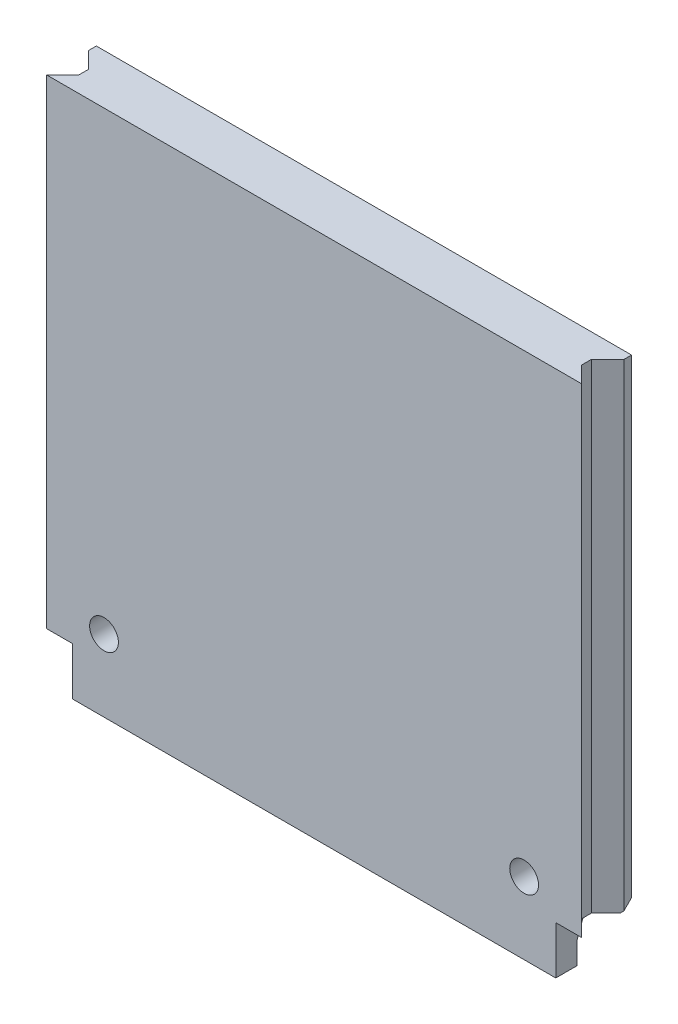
ISO-10303-21;
HEADER;
FILE_DESCRIPTION(('STEP AP214'),'2;1');
FILE_NAME('part.step','',(''),(''),'','','');
FILE_SCHEMA(('AUTOMOTIVE_DESIGN { 1 0 10303 214 1 1 1 1 }'));
ENDSEC;
DATA;
#1=APPLICATION_CONTEXT('core data for automotive mechanical design processes');
#2=APPLICATION_PROTOCOL_DEFINITION('international standard','automotive_design',2000,#1);
#3=PRODUCT_CONTEXT('',#1,'mechanical');
#4=PRODUCT('Part','Part','',(#3));
#5=PRODUCT_RELATED_PRODUCT_CATEGORY('part','',(#4));
#6=PRODUCT_DEFINITION_FORMATION('','',#4);
#7=PRODUCT_DEFINITION_CONTEXT('part definition',#1,'design');
#8=PRODUCT_DEFINITION('design','',#6,#7);
#9=PRODUCT_DEFINITION_SHAPE('','',#8);
#10=(LENGTH_UNIT() NAMED_UNIT(*) SI_UNIT(.MILLI.,.METRE.));
#11=(NAMED_UNIT(*) PLANE_ANGLE_UNIT() SI_UNIT($,.RADIAN.));
#12=(NAMED_UNIT(*) SI_UNIT($,.STERADIAN.) SOLID_ANGLE_UNIT());
#13=UNCERTAINTY_MEASURE_WITH_UNIT(LENGTH_MEASURE(1.E-05),#10,'distance_accuracy_value','');
#14=(GEOMETRIC_REPRESENTATION_CONTEXT(3) GLOBAL_UNCERTAINTY_ASSIGNED_CONTEXT((#13)) GLOBAL_UNIT_ASSIGNED_CONTEXT((#10,
#11,#12)) REPRESENTATION_CONTEXT('',''));
#15=CARTESIAN_POINT('',(0.,0.,0.));
#16=DIRECTION('',(0.,0.,1.));
#17=DIRECTION('',(1.,0.,0.));
#18=AXIS2_PLACEMENT_3D('',#15,#16,#17);
#19=CARTESIAN_POINT('',(-25.2022700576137,-5.,-1.));
#20=DIRECTION('',(1.,0.,0.));
#21=DIRECTION('',(0.,0.,-1.));
#22=AXIS2_PLACEMENT_3D('',#19,#20,#21);
#23=PLANE('',#22);
#24=DIRECTION('',(0.,1.,0.));
#25=VECTOR('',#24,1.);
#26=CARTESIAN_POINT('',(-25.2022700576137,-2.74747741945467,0.));
#27=LINE('',#26,#25);
#28=CARTESIAN_POINT('',(-25.2022700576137,-5.,0.));
#29=VERTEX_POINT('',#28);
#30=CARTESIAN_POINT('',(-25.2022700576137,-2.74747741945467,0.));
#31=VERTEX_POINT('',#30);
#32=EDGE_CURVE('E169',#29,#31,#27,.T.);
#33=ORIENTED_EDGE('',*,*,#32,.F.);
#34=DIRECTION('',(0.,0.,-1.));
#35=VECTOR('',#34,1.);
#36=CARTESIAN_POINT('',(-25.2022700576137,-5.,-1.));
#37=LINE('',#36,#35);
#38=CARTESIAN_POINT('',(-25.2022700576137,-5.,2.2));
#39=VERTEX_POINT('',#38);
#40=EDGE_CURVE('E185',#39,#29,#37,.T.);
#41=ORIENTED_EDGE('',*,*,#40,.F.);
#42=DIRECTION('',(0.,1.,0.));
#43=VECTOR('',#42,1.);
#44=CARTESIAN_POINT('',(-25.2022700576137,-5.,2.2));
#45=LINE('',#44,#43);
#46=CARTESIAN_POINT('',(-25.2022700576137,0.,2.2));
#47=VERTEX_POINT('',#46);
#48=EDGE_CURVE('E201',#39,#47,#45,.T.);
#49=ORIENTED_EDGE('',*,*,#48,.T.);
#50=DIRECTION('',(0.,0.,-1.));
#51=VECTOR('',#50,1.);
#52=CARTESIAN_POINT('',(-25.2022700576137,0.,-1.));
#53=LINE('',#52,#51);
#54=CARTESIAN_POINT('',(-25.2022700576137,0.,-1.));
#55=VERTEX_POINT('',#54);
#56=EDGE_CURVE('E207',#47,#55,#53,.T.);
#57=ORIENTED_EDGE('',*,*,#56,.T.);
#58=DIRECTION('',(0.,0.93969262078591,-0.342020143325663));
#59=VECTOR('',#58,1.);
#60=CARTESIAN_POINT('',(-25.2022700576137,0.,-1.));
#61=LINE('',#60,#59);
#62=EDGE_CURVE('E180',#31,#55,#61,.T.);
#63=ORIENTED_EDGE('',*,*,#62,.F.);
#64=EDGE_LOOP('',(#33,#41,#49,#57,#63));
#65=FACE_BOUND('',#64,.T.);
#66=ADVANCED_FACE('F50',(#65),#23,.F.);
#67=CARTESIAN_POINT('',(0.,-5.,0.));
#68=DIRECTION('',(0.,1.,0.));
#69=DIRECTION('',(0.,0.,1.));
#70=AXIS2_PLACEMENT_3D('',#67,#68,#69);
#71=PLANE('',#70);
#72=DIRECTION('',(-1.,0.,0.));
#73=VECTOR('',#72,1.);
#74=CARTESIAN_POINT('',(27.9,-5.,0.));
#75=LINE('',#74,#73);
#76=CARTESIAN_POINT('',(25.2,-5.,0.));
#77=VERTEX_POINT('',#76);
#78=EDGE_CURVE('E168',#77,#29,#75,.T.);
#79=ORIENTED_EDGE('',*,*,#78,.F.);
#80=DIRECTION('',(0.,0.,1.));
#81=VECTOR('',#80,1.);
#82=CARTESIAN_POINT('',(25.2,-5.,2.20000000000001));
#83=LINE('',#82,#81);
#84=CARTESIAN_POINT('',(25.2,-5.,2.20000000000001));
#85=VERTEX_POINT('',#84);
#86=EDGE_CURVE('E195',#77,#85,#83,.T.);
#87=ORIENTED_EDGE('',*,*,#86,.T.);
#88=DIRECTION('',(-1.,0.,0.));
#89=VECTOR('',#88,1.);
#90=CARTESIAN_POINT('',(-25.2022700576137,-5.,2.2));
#91=LINE('',#90,#89);
#92=EDGE_CURVE('E186',#85,#39,#91,.T.);
#93=ORIENTED_EDGE('',*,*,#92,.T.);
#94=ORIENTED_EDGE('',*,*,#40,.T.);
#95=EDGE_LOOP('',(#79,#87,#93,#94));
#96=FACE_BOUND('',#95,.T.);
#97=ADVANCED_FACE('F190',(#96),#71,.F.);
#98=CARTESIAN_POINT('',(0.,0.,0.));
#99=DIRECTION('',(0.,1.,0.));
#100=DIRECTION('',(0.,0.,1.));
#101=AXIS2_PLACEMENT_3D('',#98,#99,#100);
#102=PLANE('',#101);
#103=DIRECTION('',(0.,0.,1.));
#104=VECTOR('',#103,1.);
#105=CARTESIAN_POINT('',(25.2,0.,2.20000000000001));
#106=LINE('',#105,#104);
#107=CARTESIAN_POINT('',(25.2,0.,-1.));
#108=VERTEX_POINT('',#107);
#109=CARTESIAN_POINT('',(25.2,0.,2.2));
#110=VERTEX_POINT('',#109);
#111=EDGE_CURVE('E194',#108,#110,#106,.T.);
#112=ORIENTED_EDGE('',*,*,#111,.F.);
#113=DIRECTION('',(1.,0.,0.));
#114=VECTOR('',#113,1.);
#115=CARTESIAN_POINT('',(25.2,0.,-0.999999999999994));
#116=LINE('',#115,#114);
#117=EDGE_CURVE('E199',#55,#108,#116,.T.);
#118=ORIENTED_EDGE('',*,*,#117,.F.);
#119=ORIENTED_EDGE('',*,*,#56,.F.);
#120=DIRECTION('',(1.,0.,0.));
#121=VECTOR('',#120,1.);
#122=CARTESIAN_POINT('',(-27.9,0.,2.2));
#123=LINE('',#122,#121);
#124=CARTESIAN_POINT('',(-27.9,0.,2.2));
#125=VERTEX_POINT('',#124);
#126=EDGE_CURVE('E253',#125,#47,#123,.T.);
#127=ORIENTED_EDGE('',*,*,#126,.F.);
#128=DIRECTION('',(-0.707106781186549,0.,0.707106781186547));
#129=VECTOR('',#128,1.);
#130=CARTESIAN_POINT('',(-27.9,0.,2.2));
#131=LINE('',#130,#129);
#132=CARTESIAN_POINT('',(-26.2,0.,0.5));
#133=VERTEX_POINT('',#132);
#134=EDGE_CURVE('E220',#133,#125,#131,.T.);
#135=ORIENTED_EDGE('',*,*,#134,.F.);
#136=DIRECTION('',(0.,0.,1.));
#137=VECTOR('',#136,1.);
#138=CARTESIAN_POINT('',(-26.2,0.,0.5));
#139=LINE('',#138,#137);
#140=CARTESIAN_POINT('',(-26.2,0.,-0.5));
#141=VERTEX_POINT('',#140);
#142=EDGE_CURVE('E222',#141,#133,#139,.T.);
#143=ORIENTED_EDGE('',*,*,#142,.F.);
#144=DIRECTION('',(0.70710678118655,0.,0.707106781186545));
#145=VECTOR('',#144,1.);
#146=CARTESIAN_POINT('',(-26.2,0.,-0.5));
#147=LINE('',#146,#145);
#148=CARTESIAN_POINT('',(-27.7,0.,-2.));
#149=VERTEX_POINT('',#148);
#150=EDGE_CURVE('E267',#149,#141,#147,.T.);
#151=ORIENTED_EDGE('',*,*,#150,.F.);
#152=DIRECTION('',(1.,0.,0.));
#153=VECTOR('',#152,1.);
#154=CARTESIAN_POINT('',(0.,0.,-2.));
#155=LINE('',#154,#153);
#156=CARTESIAN_POINT('',(27.7,0.,-2.));
#157=VERTEX_POINT('',#156);
#158=EDGE_CURVE('E321',#149,#157,#155,.T.);
#159=ORIENTED_EDGE('',*,*,#158,.T.);
#160=DIRECTION('',(0.70710678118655,0.,-0.707106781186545));
#161=VECTOR('',#160,1.);
#162=CARTESIAN_POINT('',(26.2,0.,-0.5));
#163=LINE('',#162,#161);
#164=CARTESIAN_POINT('',(26.2,0.,-0.5));
#165=VERTEX_POINT('',#164);
#166=EDGE_CURVE('E261',#165,#157,#163,.T.);
#167=ORIENTED_EDGE('',*,*,#166,.F.);
#168=DIRECTION('',(0.,0.,-1.));
#169=VECTOR('',#168,1.);
#170=CARTESIAN_POINT('',(26.2,0.,0.5));
#171=LINE('',#170,#169);
#172=CARTESIAN_POINT('',(26.2,0.,0.5));
#173=VERTEX_POINT('',#172);
#174=EDGE_CURVE('E265',#173,#165,#171,.T.);
#175=ORIENTED_EDGE('',*,*,#174,.F.);
#176=DIRECTION('',(-0.707106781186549,0.,-0.707106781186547));
#177=VECTOR('',#176,1.);
#178=CARTESIAN_POINT('',(27.9,0.,2.2));
#179=LINE('',#178,#177);
#180=CARTESIAN_POINT('',(27.9,0.,2.2));
#181=VERTEX_POINT('',#180);
#182=EDGE_CURVE('E256',#181,#173,#179,.T.);
#183=ORIENTED_EDGE('',*,*,#182,.F.);
#184=EDGE_CURVE('E251',#110,#181,#123,.T.);
#185=ORIENTED_EDGE('',*,*,#184,.F.);
#186=EDGE_LOOP('',(#112,#118,#119,#127,#135,#143,#151,#159,#167,#175,#183,#185));
#187=FACE_BOUND('',#186,.T.);
#188=ADVANCED_FACE('F344',(#187),#102,.F.);
#189=CARTESIAN_POINT('',(-27.9,50.,2.2));
#190=DIRECTION('',(0.707106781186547,0.,0.707106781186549));
#191=DIRECTION('',(0.707106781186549,0.,-0.707106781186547));
#192=AXIS2_PLACEMENT_3D('',#189,#190,#191);
#193=PLANE('',#192);
#194=ORIENTED_EDGE('',*,*,#134,.T.);
#195=DIRECTION('',(0.,-1.,0.));
#196=VECTOR('',#195,1.);
#197=CARTESIAN_POINT('',(-27.9,50.,2.2));
#198=LINE('',#197,#196);
#199=CARTESIAN_POINT('',(-27.9,50.,2.2));
#200=VERTEX_POINT('',#199);
#201=EDGE_CURVE('E308',#200,#125,#198,.T.);
#202=ORIENTED_EDGE('',*,*,#201,.F.);
#203=DIRECTION('',(-0.707106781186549,0.,0.707106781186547));
#204=VECTOR('',#203,1.);
#205=CARTESIAN_POINT('',(-27.9,50.,2.2));
#206=LINE('',#205,#204);
#207=CARTESIAN_POINT('',(-26.2,50.,0.5));
#208=VERTEX_POINT('',#207);
#209=EDGE_CURVE('E218',#208,#200,#206,.T.);
#210=ORIENTED_EDGE('',*,*,#209,.F.);
#211=DIRECTION('',(0.,-1.,0.));
#212=VECTOR('',#211,1.);
#213=CARTESIAN_POINT('',(-26.2,50.,0.5));
#214=LINE('',#213,#212);
#215=EDGE_CURVE('E249',#208,#133,#214,.T.);
#216=ORIENTED_EDGE('',*,*,#215,.T.);
#217=EDGE_LOOP('',(#194,#202,#210,#216));
#218=FACE_BOUND('',#217,.T.);
#219=ADVANCED_FACE('F388',(#218),#193,.F.);
#220=CARTESIAN_POINT('',(-27.9,50.,2.2));
#221=DIRECTION('',(0.,0.,-1.));
#222=DIRECTION('',(-1.,0.,0.));
#223=AXIS2_PLACEMENT_3D('',#220,#221,#222);
#224=PLANE('',#223);
#225=CARTESIAN_POINT('',(21.9,2.49999999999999,2.20000000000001));
#226=DIRECTION('',(0.,0.,-1.));
#227=DIRECTION('',(-1.,0.,0.));
#228=AXIS2_PLACEMENT_3D('',#225,#226,#227);
#229=CIRCLE('',#228,1.5);
#230=CARTESIAN_POINT('',(20.4,2.49999999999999,2.20000000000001));
#231=VERTEX_POINT('',#230);
#232=EDGE_CURVE('E184',#231,#231,#229,.T.);
#233=ORIENTED_EDGE('',*,*,#232,.T.);
#234=EDGE_LOOP('',(#233));
#235=FACE_BOUND('',#234,.T.);
#236=CARTESIAN_POINT('',(-21.9,2.49999999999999,2.20000000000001));
#237=DIRECTION('',(0.,0.,-1.));
#238=DIRECTION('',(1.,0.,0.));
#239=AXIS2_PLACEMENT_3D('',#236,#237,#238);
#240=CIRCLE('',#239,1.5);
#241=CARTESIAN_POINT('',(-20.4,2.49999999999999,2.20000000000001));
#242=VERTEX_POINT('',#241);
#243=EDGE_CURVE('E353',#242,#242,#240,.T.);
#244=ORIENTED_EDGE('',*,*,#243,.T.);
#245=EDGE_LOOP('',(#244));
#246=FACE_BOUND('',#245,.T.);
#247=ORIENTED_EDGE('',*,*,#126,.T.);
#248=ORIENTED_EDGE('',*,*,#48,.F.);
#249=ORIENTED_EDGE('',*,*,#92,.F.);
#250=DIRECTION('',(0.,1.,0.));
#251=VECTOR('',#250,1.);
#252=CARTESIAN_POINT('',(25.2,-5.,2.20000000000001));
#253=LINE('',#252,#251);
#254=EDGE_CURVE('E214',#85,#110,#253,.T.);
#255=ORIENTED_EDGE('',*,*,#254,.T.);
#256=ORIENTED_EDGE('',*,*,#184,.T.);
#257=DIRECTION('',(0.,-1.,0.));
#258=VECTOR('',#257,1.);
#259=CARTESIAN_POINT('',(27.9,50.,2.2));
#260=LINE('',#259,#258);
#261=CARTESIAN_POINT('',(27.9,50.,2.2));
#262=VERTEX_POINT('',#261);
#263=EDGE_CURVE('E302',#262,#181,#260,.T.);
#264=ORIENTED_EDGE('',*,*,#263,.F.);
#265=DIRECTION('',(1.,0.,0.));
#266=VECTOR('',#265,1.);
#267=CARTESIAN_POINT('',(-27.9,50.,2.2));
#268=LINE('',#267,#266);
#269=EDGE_CURVE('E224',#200,#262,#268,.T.);
#270=ORIENTED_EDGE('',*,*,#269,.F.);
#271=ORIENTED_EDGE('',*,*,#201,.T.);
#272=EDGE_LOOP('',(#247,#248,#249,#255,#256,#264,#270,#271));
#273=FACE_BOUND('',#272,.T.);
#274=ADVANCED_FACE('F338',(#235,#246,#273),#224,.F.);
#275=CARTESIAN_POINT('',(27.9,50.,2.2));
#276=DIRECTION('',(-0.707106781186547,0.,0.707106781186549));
#277=DIRECTION('',(0.707106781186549,0.,0.707106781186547));
#278=AXIS2_PLACEMENT_3D('',#275,#276,#277);
#279=PLANE('',#278);
#280=ORIENTED_EDGE('',*,*,#182,.T.);
#281=DIRECTION('',(0.,-1.,0.));
#282=VECTOR('',#281,1.);
#283=CARTESIAN_POINT('',(26.2,50.,0.5));
#284=LINE('',#283,#282);
#285=CARTESIAN_POINT('',(26.2,50.,0.5));
#286=VERTEX_POINT('',#285);
#287=EDGE_CURVE('E297',#286,#173,#284,.T.);
#288=ORIENTED_EDGE('',*,*,#287,.F.);
#289=DIRECTION('',(-0.707106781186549,0.,-0.707106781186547));
#290=VECTOR('',#289,1.);
#291=CARTESIAN_POINT('',(27.9,50.,2.2));
#292=LINE('',#291,#290);
#293=EDGE_CURVE('E228',#262,#286,#292,.T.);
#294=ORIENTED_EDGE('',*,*,#293,.F.);
#295=ORIENTED_EDGE('',*,*,#263,.T.);
#296=EDGE_LOOP('',(#280,#288,#294,#295));
#297=FACE_BOUND('',#296,.T.);
#298=ADVANCED_FACE('F418',(#297),#279,.F.);
#299=CARTESIAN_POINT('',(26.2,50.,0.5));
#300=DIRECTION('',(-1.,0.,0.));
#301=DIRECTION('',(0.,0.,1.));
#302=AXIS2_PLACEMENT_3D('',#299,#300,#301);
#303=PLANE('',#302);
#304=ORIENTED_EDGE('',*,*,#174,.T.);
#305=DIRECTION('',(0.,-1.,0.));
#306=VECTOR('',#305,1.);
#307=CARTESIAN_POINT('',(26.2,50.,-0.5));
#308=LINE('',#307,#306);
#309=CARTESIAN_POINT('',(26.2,50.,-0.5));
#310=VERTEX_POINT('',#309);
#311=EDGE_CURVE('E298',#310,#165,#308,.T.);
#312=ORIENTED_EDGE('',*,*,#311,.F.);
#313=DIRECTION('',(0.,0.,-1.));
#314=VECTOR('',#313,1.);
#315=CARTESIAN_POINT('',(26.2,50.,0.5));
#316=LINE('',#315,#314);
#317=EDGE_CURVE('E230',#286,#310,#316,.T.);
#318=ORIENTED_EDGE('',*,*,#317,.F.);
#319=ORIENTED_EDGE('',*,*,#287,.T.);
#320=EDGE_LOOP('',(#304,#312,#318,#319));
#321=FACE_BOUND('',#320,.T.);
#322=ADVANCED_FACE('F415',(#321),#303,.F.);
#323=CARTESIAN_POINT('',(26.2,50.,-0.5));
#324=DIRECTION('',(-0.707106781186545,0.,-0.70710678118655));
#325=DIRECTION('',(-0.70710678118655,0.,0.707106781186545));
#326=AXIS2_PLACEMENT_3D('',#323,#324,#325);
#327=PLANE('',#326);
#328=ORIENTED_EDGE('',*,*,#166,.T.);
#329=DIRECTION('',(-0.57735026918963,-0.577350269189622,0.577350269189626));
#330=VECTOR('',#329,1.);
#331=CARTESIAN_POINT('',(9.83333333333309,-17.8666666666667,15.8666666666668));
#332=LINE('',#331,#330);
#333=CARTESIAN_POINT('',(27.9,0.199999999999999,-2.19999999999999));
#334=VERTEX_POINT('',#333);
#335=EDGE_CURVE('E328',#157,#334,#332,.F.);
#336=ORIENTED_EDGE('',*,*,#335,.T.);
#337=DIRECTION('',(0.,-1.,0.));
#338=VECTOR('',#337,1.);
#339=CARTESIAN_POINT('',(27.9,50.,-2.19999999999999));
#340=LINE('',#339,#338);
#341=CARTESIAN_POINT('',(27.9,50.,-2.19999999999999));
#342=VERTEX_POINT('',#341);
#343=EDGE_CURVE('E292',#342,#334,#340,.T.);
#344=ORIENTED_EDGE('',*,*,#343,.F.);
#345=DIRECTION('',(0.70710678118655,0.,-0.707106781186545));
#346=VECTOR('',#345,1.);
#347=CARTESIAN_POINT('',(26.2,50.,-0.5));
#348=LINE('',#347,#346);
#349=EDGE_CURVE('E235',#310,#342,#348,.T.);
#350=ORIENTED_EDGE('',*,*,#349,.F.);
#351=ORIENTED_EDGE('',*,*,#311,.T.);
#352=EDGE_LOOP('',(#328,#336,#344,#350,#351));
#353=FACE_BOUND('',#352,.T.);
#354=ADVANCED_FACE('F409',(#353),#327,.F.);
#355=CARTESIAN_POINT('',(27.9,50.,-2.19999999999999));
#356=DIRECTION('',(-1.,0.,0.));
#357=DIRECTION('',(0.,0.,1.));
#358=AXIS2_PLACEMENT_3D('',#355,#356,#357);
#359=PLANE('',#358);
#360=ORIENTED_EDGE('',*,*,#343,.T.);
#361=DIRECTION('',(0.,-0.707106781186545,0.70710678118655));
#362=VECTOR('',#361,1.);
#363=CARTESIAN_POINT('',(27.9,1.00000000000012,-3.00000000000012));
#364=LINE('',#363,#362);
#365=CARTESIAN_POINT('',(27.9,0.999999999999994,-3.));
#366=VERTEX_POINT('',#365);
#367=EDGE_CURVE('E333',#334,#366,#364,.F.);
#368=ORIENTED_EDGE('',*,*,#367,.T.);
#369=DIRECTION('',(0.,-1.,0.));
#370=VECTOR('',#369,1.);
#371=CARTESIAN_POINT('',(27.9,50.,-3.));
#372=LINE('',#371,#370);
#373=CARTESIAN_POINT('',(27.9,50.,-3.));
#374=VERTEX_POINT('',#373);
#375=EDGE_CURVE('E287',#374,#366,#372,.T.);
#376=ORIENTED_EDGE('',*,*,#375,.F.);
#377=DIRECTION('',(0.,0.,-1.));
#378=VECTOR('',#377,1.);
#379=CARTESIAN_POINT('',(27.9,50.,-2.19999999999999));
#380=LINE('',#379,#378);
#381=EDGE_CURVE('E232',#342,#374,#380,.T.);
#382=ORIENTED_EDGE('',*,*,#381,.F.);
#383=EDGE_LOOP('',(#360,#368,#376,#382));
#384=FACE_BOUND('',#383,.T.);
#385=ADVANCED_FACE('F404',(#384),#359,.F.);
#386=CARTESIAN_POINT('',(-27.9,50.,-3.));
#387=DIRECTION('',(0.,0.,1.));
#388=DIRECTION('',(1.,0.,0.));
#389=AXIS2_PLACEMENT_3D('',#386,#387,#388);
#390=PLANE('',#389);
#391=DIRECTION('',(-1.,0.,0.));
#392=VECTOR('',#391,1.);
#393=CARTESIAN_POINT('',(-27.9,0.999999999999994,-3.));
#394=LINE('',#393,#392);
#395=CARTESIAN_POINT('',(21.9,0.999999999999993,-3.));
#396=VERTEX_POINT('',#395);
#397=EDGE_CURVE('E312',#366,#396,#394,.T.);
#398=ORIENTED_EDGE('',*,*,#397,.T.);
#399=CARTESIAN_POINT('',(21.9,2.49999999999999,-3.));
#400=DIRECTION('',(0.,0.,-1.));
#401=DIRECTION('',(-1.,0.,0.));
#402=AXIS2_PLACEMENT_3D('',#399,#400,#401);
#403=CIRCLE('',#402,1.5);
#404=EDGE_CURVE('E70',#396,#396,#403,.T.);
#405=ORIENTED_EDGE('',*,*,#404,.F.);
#406=CARTESIAN_POINT('',(-21.9,0.999999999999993,-3.));
#407=VERTEX_POINT('',#406);
#408=EDGE_CURVE('E319',#396,#407,#394,.T.);
#409=ORIENTED_EDGE('',*,*,#408,.T.);
#410=CARTESIAN_POINT('',(-21.9,2.49999999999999,-3.));
#411=DIRECTION('',(0.,0.,-1.));
#412=DIRECTION('',(1.,0.,0.));
#413=AXIS2_PLACEMENT_3D('',#410,#411,#412);
#414=CIRCLE('',#413,1.5);
#415=EDGE_CURVE('E65',#407,#407,#414,.T.);
#416=ORIENTED_EDGE('',*,*,#415,.F.);
#417=CARTESIAN_POINT('',(-27.9,0.999999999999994,-3.));
#418=VERTEX_POINT('',#417);
#419=EDGE_CURVE('E315',#407,#418,#394,.T.);
#420=ORIENTED_EDGE('',*,*,#419,.T.);
#421=DIRECTION('',(0.,-1.,0.));
#422=VECTOR('',#421,1.);
#423=CARTESIAN_POINT('',(-27.9,50.,-3.));
#424=LINE('',#423,#422);
#425=CARTESIAN_POINT('',(-27.9,50.,-3.));
#426=VERTEX_POINT('',#425);
#427=EDGE_CURVE('E284',#426,#418,#424,.T.);
#428=ORIENTED_EDGE('',*,*,#427,.F.);
#429=DIRECTION('',(-1.,0.,0.));
#430=VECTOR('',#429,1.);
#431=CARTESIAN_POINT('',(-27.9,50.,-3.));
#432=LINE('',#431,#430);
#433=EDGE_CURVE('E238',#374,#426,#432,.T.);
#434=ORIENTED_EDGE('',*,*,#433,.F.);
#435=ORIENTED_EDGE('',*,*,#375,.T.);
#436=EDGE_LOOP('',(#398,#405,#409,#416,#420,#428,#434,#435));
#437=FACE_BOUND('',#436,.T.);
#438=ADVANCED_FACE('F396',(#437),#390,.F.);
#439=CARTESIAN_POINT('',(-27.9,50.,-2.19999999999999));
#440=DIRECTION('',(1.,0.,0.));
#441=DIRECTION('',(0.,0.,-1.));
#442=AXIS2_PLACEMENT_3D('',#439,#440,#441);
#443=PLANE('',#442);
#444=ORIENTED_EDGE('',*,*,#427,.T.);
#445=DIRECTION('',(0.,0.707106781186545,-0.70710678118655));
#446=VECTOR('',#445,1.);
#447=CARTESIAN_POINT('',(-27.9,0.999999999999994,-3.));
#448=LINE('',#447,#446);
#449=CARTESIAN_POINT('',(-27.9,0.199999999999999,-2.19999999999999));
#450=VERTEX_POINT('',#449);
#451=EDGE_CURVE('E320',#418,#450,#448,.F.);
#452=ORIENTED_EDGE('',*,*,#451,.T.);
#453=DIRECTION('',(0.,-1.,0.));
#454=VECTOR('',#453,1.);
#455=CARTESIAN_POINT('',(-27.9,50.,-2.19999999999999));
#456=LINE('',#455,#454);
#457=CARTESIAN_POINT('',(-27.9,50.,-2.19999999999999));
#458=VERTEX_POINT('',#457);
#459=EDGE_CURVE('E278',#458,#450,#456,.T.);
#460=ORIENTED_EDGE('',*,*,#459,.F.);
#461=DIRECTION('',(0.,0.,1.));
#462=VECTOR('',#461,1.);
#463=CARTESIAN_POINT('',(-27.9,50.,-2.19999999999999));
#464=LINE('',#463,#462);
#465=EDGE_CURVE('E241',#426,#458,#464,.T.);
#466=ORIENTED_EDGE('',*,*,#465,.F.);
#467=EDGE_LOOP('',(#444,#452,#460,#466));
#468=FACE_BOUND('',#467,.T.);
#469=ADVANCED_FACE('F398',(#468),#443,.F.);
#470=CARTESIAN_POINT('',(-26.2,50.,-0.5));
#471=DIRECTION('',(0.707106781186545,0.,-0.70710678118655));
#472=DIRECTION('',(-0.70710678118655,0.,-0.707106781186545));
#473=AXIS2_PLACEMENT_3D('',#470,#471,#472);
#474=PLANE('',#473);
#475=ORIENTED_EDGE('',*,*,#459,.T.);
#476=DIRECTION('',(-0.57735026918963,0.577350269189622,-0.577350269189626));
#477=VECTOR('',#476,1.);
#478=CARTESIAN_POINT('',(-28.4333333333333,0.733333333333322,-2.73333333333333));
#479=LINE('',#478,#477);
#480=EDGE_CURVE('E322',#450,#149,#479,.F.);
#481=ORIENTED_EDGE('',*,*,#480,.T.);
#482=ORIENTED_EDGE('',*,*,#150,.T.);
#483=DIRECTION('',(0.,-1.,0.));
#484=VECTOR('',#483,1.);
#485=CARTESIAN_POINT('',(-26.2,50.,-0.5));
#486=LINE('',#485,#484);
#487=CARTESIAN_POINT('',(-26.2,50.,-0.5));
#488=VERTEX_POINT('',#487);
#489=EDGE_CURVE('E277',#488,#141,#486,.T.);
#490=ORIENTED_EDGE('',*,*,#489,.F.);
#491=DIRECTION('',(0.70710678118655,0.,0.707106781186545));
#492=VECTOR('',#491,1.);
#493=CARTESIAN_POINT('',(-26.2,50.,-0.5));
#494=LINE('',#493,#492);
#495=EDGE_CURVE('E242',#458,#488,#494,.T.);
#496=ORIENTED_EDGE('',*,*,#495,.F.);
#497=EDGE_LOOP('',(#475,#481,#482,#490,#496));
#498=FACE_BOUND('',#497,.T.);
#499=ADVANCED_FACE('F393',(#498),#474,.F.);
#500=CARTESIAN_POINT('',(-26.2,50.,0.5));
#501=DIRECTION('',(1.,0.,0.));
#502=DIRECTION('',(0.,0.,-1.));
#503=AXIS2_PLACEMENT_3D('',#500,#501,#502);
#504=PLANE('',#503);
#505=ORIENTED_EDGE('',*,*,#142,.T.);
#506=ORIENTED_EDGE('',*,*,#215,.F.);
#507=DIRECTION('',(0.,0.,1.));
#508=VECTOR('',#507,1.);
#509=CARTESIAN_POINT('',(-26.2,50.,0.5));
#510=LINE('',#509,#508);
#511=EDGE_CURVE('E250',#488,#208,#510,.T.);
#512=ORIENTED_EDGE('',*,*,#511,.F.);
#513=ORIENTED_EDGE('',*,*,#489,.T.);
#514=EDGE_LOOP('',(#505,#506,#512,#513));
#515=FACE_BOUND('',#514,.T.);
#516=ADVANCED_FACE('F387',(#515),#504,.F.);
#517=CARTESIAN_POINT('',(0.,50.,0.));
#518=DIRECTION('',(0.,1.,0.));
#519=DIRECTION('',(0.,0.,1.));
#520=AXIS2_PLACEMENT_3D('',#517,#518,#519);
#521=PLANE('',#520);
#522=ORIENTED_EDGE('',*,*,#209,.T.);
#523=ORIENTED_EDGE('',*,*,#269,.T.);
#524=ORIENTED_EDGE('',*,*,#293,.T.);
#525=ORIENTED_EDGE('',*,*,#317,.T.);
#526=ORIENTED_EDGE('',*,*,#349,.T.);
#527=ORIENTED_EDGE('',*,*,#381,.T.);
#528=ORIENTED_EDGE('',*,*,#433,.T.);
#529=ORIENTED_EDGE('',*,*,#465,.T.);
#530=ORIENTED_EDGE('',*,*,#495,.T.);
#531=ORIENTED_EDGE('',*,*,#511,.T.);
#532=EDGE_LOOP('',(#522,#523,#524,#525,#526,#527,#528,#529,#530,#531));
#533=FACE_BOUND('',#532,.T.);
#534=ADVANCED_FACE('F384',(#533),#521,.T.);
#535=CARTESIAN_POINT('',(-27.9,0.999999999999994,-3.));
#536=DIRECTION('',(0.,0.70710678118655,0.707106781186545));
#537=DIRECTION('',(-1.,0.,0.));
#538=AXIS2_PLACEMENT_3D('',#535,#536,#537);
#539=PLANE('',#538);
#540=ORIENTED_EDGE('',*,*,#335,.F.);
#541=ORIENTED_EDGE('',*,*,#158,.F.);
#542=ORIENTED_EDGE('',*,*,#480,.F.);
#543=ORIENTED_EDGE('',*,*,#451,.F.);
#544=ORIENTED_EDGE('',*,*,#419,.F.);
#545=ORIENTED_EDGE('',*,*,#408,.F.);
#546=ORIENTED_EDGE('',*,*,#397,.F.);
#547=ORIENTED_EDGE('',*,*,#367,.F.);
#548=EDGE_LOOP('',(#540,#541,#542,#543,#544,#545,#546,#547));
#549=FACE_BOUND('',#548,.T.);
#550=ADVANCED_FACE('F49',(#549),#539,.F.);
#551=CARTESIAN_POINT('',(25.2,-5.,2.20000000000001));
#552=DIRECTION('',(-1.,0.,0.));
#553=DIRECTION('',(0.,0.,1.));
#554=AXIS2_PLACEMENT_3D('',#551,#552,#553);
#555=PLANE('',#554);
#556=DIRECTION('',(0.,1.,0.));
#557=VECTOR('',#556,1.);
#558=CARTESIAN_POINT('',(25.2,-5.,0.));
#559=LINE('',#558,#557);
#560=CARTESIAN_POINT('',(25.2,-2.74747741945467,0.));
#561=VERTEX_POINT('',#560);
#562=EDGE_CURVE('E60',#77,#561,#559,.T.);
#563=ORIENTED_EDGE('',*,*,#562,.T.);
#564=DIRECTION('',(0.,0.939692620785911,-0.342020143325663));
#565=VECTOR('',#564,1.);
#566=CARTESIAN_POINT('',(25.2,-5.44357128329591,0.981297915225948));
#567=LINE('',#566,#565);
#568=EDGE_CURVE('E11',#561,#108,#567,.T.);
#569=ORIENTED_EDGE('',*,*,#568,.T.);
#570=ORIENTED_EDGE('',*,*,#111,.T.);
#571=ORIENTED_EDGE('',*,*,#254,.F.);
#572=ORIENTED_EDGE('',*,*,#86,.F.);
#573=EDGE_LOOP('',(#563,#569,#570,#571,#572));
#574=FACE_BOUND('',#573,.T.);
#575=ADVANCED_FACE('F331',(#574),#555,.F.);
#576=CARTESIAN_POINT('',(27.9,0.,-1.));
#577=DIRECTION('',(0.,0.342020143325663,0.93969262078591));
#578=DIRECTION('',(0.,-0.939692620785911,0.342020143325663));
#579=AXIS2_PLACEMENT_3D('',#576,#577,#578);
#580=PLANE('',#579);
#581=DIRECTION('',(-1.,0.,0.));
#582=VECTOR('',#581,1.);
#583=CARTESIAN_POINT('',(27.9,-2.74747741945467,0.));
#584=LINE('',#583,#582);
#585=EDGE_CURVE('E176',#561,#31,#584,.T.);
#586=ORIENTED_EDGE('',*,*,#585,.T.);
#587=ORIENTED_EDGE('',*,*,#62,.T.);
#588=ORIENTED_EDGE('',*,*,#117,.T.);
#589=ORIENTED_EDGE('',*,*,#568,.F.);
#590=EDGE_LOOP('',(#586,#587,#588,#589));
#591=FACE_BOUND('',#590,.T.);
#592=ADVANCED_FACE('F347',(#591),#580,.F.);
#593=CARTESIAN_POINT('',(27.9,-2.74747741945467,0.));
#594=DIRECTION('',(0.,0.,1.));
#595=DIRECTION('',(0.,-1.,0.));
#596=AXIS2_PLACEMENT_3D('',#593,#594,#595);
#597=PLANE('',#596);
#598=ORIENTED_EDGE('',*,*,#78,.T.);
#599=ORIENTED_EDGE('',*,*,#32,.T.);
#600=ORIENTED_EDGE('',*,*,#585,.F.);
#601=ORIENTED_EDGE('',*,*,#562,.F.);
#602=EDGE_LOOP('',(#598,#599,#600,#601));
#603=FACE_BOUND('',#602,.T.);
#604=ADVANCED_FACE('F166',(#603),#597,.F.);
#605=CARTESIAN_POINT('',(-21.9,2.49999999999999,2.20000000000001));
#606=DIRECTION('',(0.,0.,-1.));
#607=DIRECTION('',(-1.,0.,0.));
#608=AXIS2_PLACEMENT_3D('',#605,#606,#607);
#609=CYLINDRICAL_SURFACE('',#608,1.5);
#610=ORIENTED_EDGE('',*,*,#243,.F.);
#611=EDGE_LOOP('',(#610));
#612=FACE_BOUND('',#611,.T.);
#613=ORIENTED_EDGE('',*,*,#415,.T.);
#614=EDGE_LOOP('',(#613));
#615=FACE_BOUND('',#614,.T.);
#616=ADVANCED_FACE('F370',(#612,#615),#609,.F.);
#617=CARTESIAN_POINT('',(21.9,2.49999999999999,2.20000000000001));
#618=DIRECTION('',(0.,0.,-1.));
#619=DIRECTION('',(-1.,0.,0.));
#620=AXIS2_PLACEMENT_3D('',#617,#618,#619);
#621=CYLINDRICAL_SURFACE('',#620,1.5);
#622=ORIENTED_EDGE('',*,*,#232,.F.);
#623=EDGE_LOOP('',(#622));
#624=FACE_BOUND('',#623,.T.);
#625=ORIENTED_EDGE('',*,*,#404,.T.);
#626=EDGE_LOOP('',(#625));
#627=FACE_BOUND('',#626,.T.);
#628=ADVANCED_FACE('F362',(#624,#627),#621,.F.);
#629=CLOSED_SHELL('',(#66,#97,#188,#219,#274,#298,#322,#354,#385,#438,#469,#499,#516,#534,#550,
#575,#592,#604,#616,#628));
#630=MANIFOLD_SOLID_BREP('B2',#629);
#631=ADVANCED_BREP_SHAPE_REPRESENTATION('',(#18,#630),#14);
#632=SHAPE_DEFINITION_REPRESENTATION(#9,#631);
ENDSEC;
END-ISO-10303-21;
